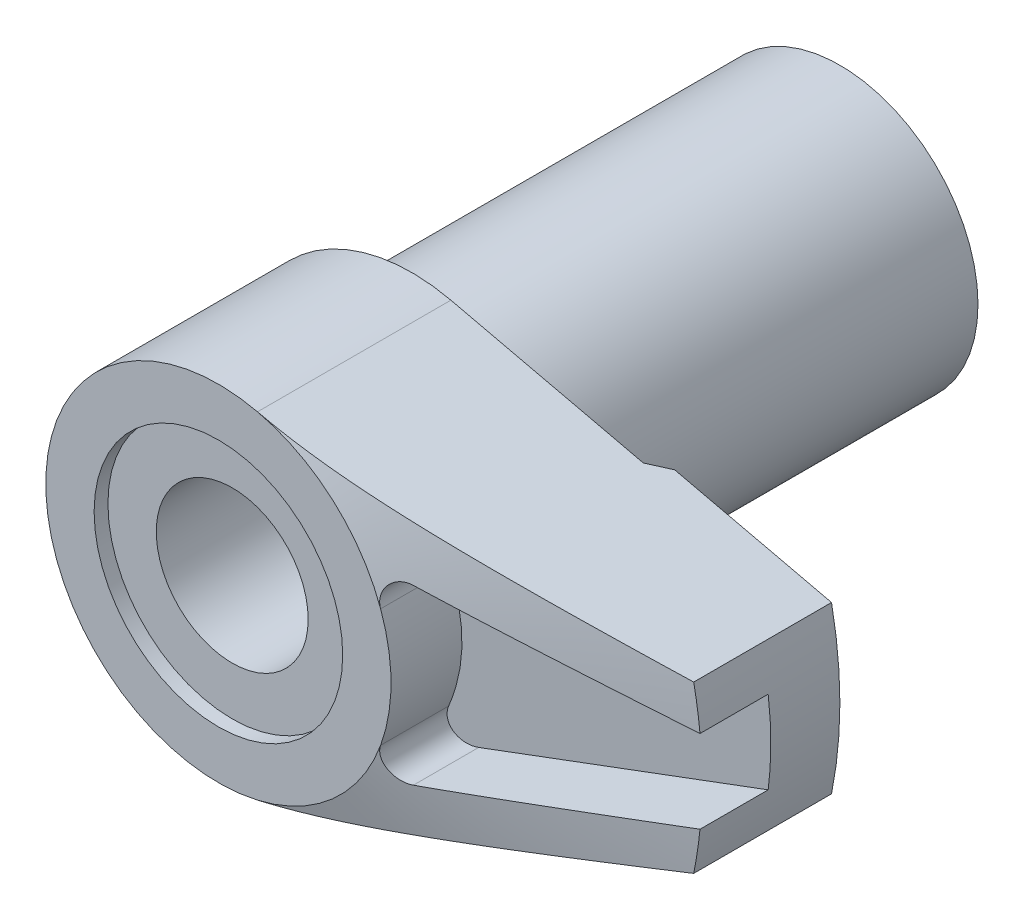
ISO-10303-21;
HEADER;
FILE_DESCRIPTION(('STEP AP214'),'2;1');
FILE_NAME('part.step','',(''),(''),'','','');
FILE_SCHEMA(('AUTOMOTIVE_DESIGN { 1 0 10303 214 1 1 1 1 }'));
ENDSEC;
DATA;
#1=APPLICATION_CONTEXT('core data for automotive mechanical design processes');
#2=APPLICATION_PROTOCOL_DEFINITION('international standard','automotive_design',2000,#1);
#3=PRODUCT_CONTEXT('',#1,'mechanical');
#4=PRODUCT('Part','Part','',(#3));
#5=PRODUCT_RELATED_PRODUCT_CATEGORY('part','',(#4));
#6=PRODUCT_DEFINITION_FORMATION('','',#4);
#7=PRODUCT_DEFINITION_CONTEXT('part definition',#1,'design');
#8=PRODUCT_DEFINITION('design','',#6,#7);
#9=PRODUCT_DEFINITION_SHAPE('','',#8);
#10=(LENGTH_UNIT() NAMED_UNIT(*) SI_UNIT(.MILLI.,.METRE.));
#11=(NAMED_UNIT(*) PLANE_ANGLE_UNIT() SI_UNIT($,.RADIAN.));
#12=(NAMED_UNIT(*) SI_UNIT($,.STERADIAN.) SOLID_ANGLE_UNIT());
#13=UNCERTAINTY_MEASURE_WITH_UNIT(LENGTH_MEASURE(1.E-05),#10,'distance_accuracy_value','');
#14=(GEOMETRIC_REPRESENTATION_CONTEXT(3) GLOBAL_UNCERTAINTY_ASSIGNED_CONTEXT((#13)) GLOBAL_UNIT_ASSIGNED_CONTEXT((#10,
#11,#12)) REPRESENTATION_CONTEXT('',''));
#15=CARTESIAN_POINT('',(0.,0.,0.));
#16=DIRECTION('',(0.,0.,1.));
#17=DIRECTION('',(1.,0.,0.));
#18=AXIS2_PLACEMENT_3D('',#15,#16,#17);
#19=CARTESIAN_POINT('',(29.8496231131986,-3.,45.));
#20=DIRECTION('',(0.195151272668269,-0.980773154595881,0.));
#21=DIRECTION('',(0.980773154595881,0.195151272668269,0.));
#22=AXIS2_PLACEMENT_3D('',#19,#20,#21);
#23=PLANE('',#22);
#24=CARTESIAN_POINT('',(29.8498231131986,-2.99996020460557,39.9783689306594));
#25=CARTESIAN_POINT('',(29.1687337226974,-3.13548130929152,40.1689219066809));
#26=CARTESIAN_POINT('',(28.487503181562,-3.2710304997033,40.3589529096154));
#27=CARTESIAN_POINT('',(27.1246794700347,-3.54220103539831,40.7376555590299));
#28=CARTESIAN_POINT('',(26.4430862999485,-3.67782238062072,40.9263272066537));
#29=CARTESIAN_POINT('',(25.0795104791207,-3.94914256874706,41.3019810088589));
#30=CARTESIAN_POINT('',(24.3975278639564,-4.08484140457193,41.488963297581));
#31=CARTESIAN_POINT('',(23.0330055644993,-4.35634992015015,41.8608024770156));
#32=CARTESIAN_POINT('',(22.350465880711,-4.49215959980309,42.0456593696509));
#33=CARTESIAN_POINT('',(20.9846213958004,-4.76393119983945,42.4126500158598));
#34=CARTESIAN_POINT('',(20.3013165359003,-4.89989313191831,42.5947835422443));
#35=CARTESIAN_POINT('',(18.9337996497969,-5.17199750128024,42.9554552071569));
#36=CARTESIAN_POINT('',(18.2495876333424,-5.30813993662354,43.1339933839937));
#37=CARTESIAN_POINT('',(17.2223410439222,-5.51253835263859,43.3981748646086));
#38=CARTESIAN_POINT('',(16.8797558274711,-5.58070492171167,43.4856347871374));
#39=CARTESIAN_POINT('',(16.1942391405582,-5.71710695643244,43.6591294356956));
#40=CARTESIAN_POINT('',(15.8513076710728,-5.78534242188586,43.7451641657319));
#41=CARTESIAN_POINT('',(15.1650328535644,-5.92189530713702,43.9155661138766));
#42=CARTESIAN_POINT('',(14.8216894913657,-5.99021272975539,43.9999332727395));
#43=CARTESIAN_POINT('',(14.1345343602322,-6.12694077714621,44.1666746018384));
#44=CARTESIAN_POINT('',(13.7907225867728,-6.19535140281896,44.2490487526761));
#45=CARTESIAN_POINT('',(13.4466456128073,-6.26381479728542,44.3302644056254));
#46=B_SPLINE_CURVE_WITH_KNOTS('',3,(#24,#25,#26,#27,#28,#29,#30,#31,#32,#33,#34,#35,#36,#37,#38,
#39,#40,#41,#42,#43,#44,#45),.UNSPECIFIED.,.F.,.F.,(4,2,2,2,2,2,2,2,2,2,4),(0.,2.16033236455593,
4.32066291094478,6.48082038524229,8.64097590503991,10.8013106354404,12.9616223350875,
14.0418721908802,15.1221190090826,16.2024041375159,17.2826997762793),.UNSPECIFIED.);
#47=CARTESIAN_POINT('',(29.8496231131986,-3.,39.9784248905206));
#48=VERTEX_POINT('',#47);
#49=CARTESIAN_POINT('',(13.4468456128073,-6.26377500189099,44.3302172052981));
#50=VERTEX_POINT('',#49);
#51=EDGE_CURVE('E35',#48,#50,#46,.T.);
#52=ORIENTED_EDGE('',*,*,#51,.F.);
#53=DIRECTION('',(0.,0.,-1.));
#54=VECTOR('',#53,1.);
#55=CARTESIAN_POINT('',(29.8496231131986,-3.,45.));
#56=LINE('',#55,#54);
#57=CARTESIAN_POINT('',(29.8496231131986,-3.,35.0417713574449));
#58=VERTEX_POINT('',#57);
#59=EDGE_CURVE('E268',#48,#58,#56,.T.);
#60=ORIENTED_EDGE('',*,*,#59,.T.);
#61=DIRECTION('',(0.946284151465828,0.188288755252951,-0.262856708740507));
#62=VECTOR('',#61,1.);
#63=CARTESIAN_POINT('',(27.3726418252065,-3.49286223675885,35.7298217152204));
#64=LINE('',#63,#62);
#65=CARTESIAN_POINT('',(13.4468456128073,-6.263775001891,39.5980984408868));
#66=VERTEX_POINT('',#65);
#67=EDGE_CURVE('E251',#66,#58,#64,.T.);
#68=ORIENTED_EDGE('',*,*,#67,.F.);
#69=DIRECTION('',(0.,0.,1.));
#70=VECTOR('',#69,1.);
#71=CARTESIAN_POINT('',(13.4468456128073,-6.26377500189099,35.));
#72=LINE('',#71,#70);
#73=EDGE_CURVE('E242',#66,#50,#72,.T.);
#74=ORIENTED_EDGE('',*,*,#73,.T.);
#75=EDGE_LOOP('',(#52,#60,#68,#74));
#76=FACE_BOUND('',#75,.T.);
#77=ADVANCED_FACE('F14',(#76),#23,.F.);
#78=CARTESIAN_POINT('',(29.3938769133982,6.,2.72821971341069));
#79=DIRECTION('',(0.226436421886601,0.974025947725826,0.));
#80=DIRECTION('',(-0.974025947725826,0.226436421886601,0.));
#81=AXIS2_PLACEMENT_3D('',#78,#79,#80);
#82=PLANE('',#81);
#83=DIRECTION('',(0.,0.,-1.));
#84=VECTOR('',#83,1.);
#85=CARTESIAN_POINT('',(2.83045527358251,12.1753243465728,80.3553390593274));
#86=LINE('',#85,#84);
#87=CARTESIAN_POINT('',(2.83045527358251,12.1753243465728,31.));
#88=VERTEX_POINT('',#87);
#89=CARTESIAN_POINT('',(2.83045527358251,12.1753243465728,45.));
#90=VERTEX_POINT('',#89);
#91=EDGE_CURVE('E139',#88,#90,#86,.F.);
#92=ORIENTED_EDGE('',*,*,#91,.T.);
#93=CARTESIAN_POINT('',(2.83025527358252,12.1753708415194,44.9999999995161));
#94=CARTESIAN_POINT('',(3.09211591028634,12.1144948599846,45.0000130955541));
#95=CARTESIAN_POINT('',(3.35397482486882,12.0536192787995,44.997514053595));
#96=CARTESIAN_POINT('',(3.87759687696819,11.931890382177,44.9875784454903));
#97=CARTESIAN_POINT('',(4.13936001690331,11.8710370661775,44.9801420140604));
#98=CARTESIAN_POINT('',(4.66262694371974,11.7493907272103,44.9604215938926));
#99=CARTESIAN_POINT('',(4.92413078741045,11.6885976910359,44.9481391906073));
#100=CARTESIAN_POINT('',(5.44688844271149,11.5670697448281,44.9188930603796));
#101=CARTESIAN_POINT('',(5.70814225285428,11.5063348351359,44.9019293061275));
#102=CARTESIAN_POINT('',(6.49037533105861,11.3244854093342,44.8443975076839));
#103=CARTESIAN_POINT('',(7.01089819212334,11.2034769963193,44.7971469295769));
#104=CARTESIAN_POINT('',(8.05036742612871,10.9618266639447,44.6868706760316));
#105=CARTESIAN_POINT('',(8.56931366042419,10.8411847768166,44.6238436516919));
#106=CARTESIAN_POINT('',(9.60376375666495,10.6007012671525,44.4845514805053));
#107=CARTESIAN_POINT('',(10.1192733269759,10.4808583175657,44.4083306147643));
#108=CARTESIAN_POINT('',(11.1485811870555,10.2415702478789,44.2447054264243));
#109=CARTESIAN_POINT('',(11.6623795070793,10.1221251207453,44.1573013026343));
#110=CARTESIAN_POINT('',(12.6886898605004,9.88353389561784,43.9732118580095));
#111=CARTESIAN_POINT('',(13.201200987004,9.76438800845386,43.8765212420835));
#112=CARTESIAN_POINT('',(14.2248137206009,9.52642391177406,43.6755593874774));
#113=CARTESIAN_POINT('',(14.7359153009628,9.40760570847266,43.5712880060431));
#114=CARTESIAN_POINT('',(15.8393219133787,9.15109155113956,43.3391980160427));
#115=CARTESIAN_POINT('',(16.4314101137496,9.01344600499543,43.2102962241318));
#116=CARTESIAN_POINT('',(17.6141698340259,8.73848425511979,42.9458355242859));
#117=CARTESIAN_POINT('',(18.2048413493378,8.60116805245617,42.8102765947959));
#118=CARTESIAN_POINT('',(19.3848692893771,8.32684137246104,42.5338554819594));
#119=CARTESIAN_POINT('',(19.9742259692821,8.18983083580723,42.3929944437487));
#120=CARTESIAN_POINT('',(21.1519474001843,7.91604036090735,42.1069682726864));
#121=CARTESIAN_POINT('',(21.7403121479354,7.77926042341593,41.9618031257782));
#122=CARTESIAN_POINT('',(22.9184201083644,7.5053800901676,41.6674151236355));
#123=CARTESIAN_POINT('',(23.5081601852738,7.36828042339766,41.5181790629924));
#124=CARTESIAN_POINT('',(24.6869369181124,7.09424461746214,41.216804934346));
#125=CARTESIAN_POINT('',(25.2759735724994,6.95730847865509,41.0646668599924));
#126=CARTESIAN_POINT('',(26.4534793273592,6.68356814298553,40.7579835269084));
#127=CARTESIAN_POINT('',(27.0419484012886,6.54676395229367,40.6034381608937));
#128=CARTESIAN_POINT('',(28.218374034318,6.27327471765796,40.2923263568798));
#129=CARTESIAN_POINT('',(28.8063305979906,6.13658967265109,40.1357599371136));
#130=CARTESIAN_POINT('',(29.3940769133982,5.99995350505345,39.9783713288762));
#131=B_SPLINE_CURVE_WITH_KNOTS('',3,(#93,#94,#95,#96,#97,#98,#99,#100,#101,#102,#103,#104,#105,
#106,#107,#108,#109,#110,#111,#112,#113,#114,#115,#116,#117,#118,#119,#120,#121,#122,#123,#124,
#125,#126,#127,#128,#129,#130),.UNSPECIFIED.,.F.,.F.,(4,2,2,2,2,2,2,2,2,2,2,2,2,2,2,2,2,2,4),
(0.,0.806516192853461,1.61301038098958,2.41924092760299,3.22547617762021,4.83464442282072,
6.44395030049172,8.04795620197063,9.65193359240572,11.2568310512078,12.861758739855,
14.7258920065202,16.5900313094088,18.4537702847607,20.3175153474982,22.1882685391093,
24.0590258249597,25.9298667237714,27.8006907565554),.UNSPECIFIED.);
#132=CARTESIAN_POINT('',(29.3938769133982,6.,39.9784248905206));
#133=VERTEX_POINT('',#132);
#134=EDGE_CURVE('E110',#90,#133,#131,.T.);
#135=ORIENTED_EDGE('',*,*,#134,.T.);
#136=DIRECTION('',(0.,0.,-1.));
#137=VECTOR('',#136,1.);
#138=CARTESIAN_POINT('',(29.3938769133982,6.,45.));
#139=LINE('',#138,#137);
#140=CARTESIAN_POINT('',(29.3938769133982,6.,30.));
#141=VERTEX_POINT('',#140);
#142=EDGE_CURVE('E295',#133,#141,#139,.T.);
#143=ORIENTED_EDGE('',*,*,#142,.T.);
#144=DIRECTION('',(0.974025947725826,-0.226436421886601,0.));
#145=VECTOR('',#144,1.);
#146=CARTESIAN_POINT('',(29.3938769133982,6.,30.));
#147=LINE('',#146,#145);
#148=CARTESIAN_POINT('',(18.0374305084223,8.64008684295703,30.));
#149=VERTEX_POINT('',#148);
#150=EDGE_CURVE('E142',#149,#141,#147,.T.);
#151=ORIENTED_EDGE('',*,*,#150,.F.);
#152=CARTESIAN_POINT('',(30.4238571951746,5.76055560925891,19.0355835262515));
#153=CARTESIAN_POINT('',(30.028822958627,5.85239108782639,19.4066268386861));
#154=CARTESIAN_POINT('',(29.6331674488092,5.94437099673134,19.7769743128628));
#155=CARTESIAN_POINT('',(28.8404369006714,6.12866081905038,20.5160704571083));
#156=CARTESIAN_POINT('',(28.443361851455,6.22097073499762,20.8848191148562));
#157=CARTESIAN_POINT('',(27.647548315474,6.40597727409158,21.6205722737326));
#158=CARTESIAN_POINT('',(27.2488095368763,6.4986739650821,21.9875764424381));
#159=CARTESIAN_POINT('',(26.4495266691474,6.68448703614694,22.7195031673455));
#160=CARTESIAN_POINT('',(26.0489825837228,6.77760341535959,23.0844257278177));
#161=CARTESIAN_POINT('',(24.8423212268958,7.05812169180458,24.1774168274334));
#162=CARTESIAN_POINT('',(24.0331157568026,7.24624151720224,24.9019094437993));
#163=CARTESIAN_POINT('',(22.8112301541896,7.53029904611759,25.9789264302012));
#164=CARTESIAN_POINT('',(22.4026033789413,7.62529444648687,26.3362992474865));
#165=CARTESIAN_POINT('',(21.5822014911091,7.81601715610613,27.047210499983));
#166=CARTESIAN_POINT('',(21.1704263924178,7.91174446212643,27.4007489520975));
#167=CARTESIAN_POINT('',(20.1078304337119,8.15877117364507,28.3032347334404));
#168=CARTESIAN_POINT('',(19.454335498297,8.31069223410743,28.8488840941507));
#169=CARTESIAN_POINT('',(18.4653749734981,8.54060056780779,29.6562027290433));
#170=CARTESIAN_POINT('',(18.1342417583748,8.61758067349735,29.9234705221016));
#171=CARTESIAN_POINT('',(17.4686623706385,8.77231106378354,30.4536179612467));
#172=CARTESIAN_POINT('',(17.1342162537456,8.85006133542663,30.7164976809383));
#173=CARTESIAN_POINT('',(16.4612692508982,9.00650451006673,31.2372989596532));
#174=CARTESIAN_POINT('',(16.122765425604,9.08519809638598,31.4952165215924));
#175=CARTESIAN_POINT('',(15.4413841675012,9.24360202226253,32.0049142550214));
#176=CARTESIAN_POINT('',(15.09850665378,9.32331238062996,32.2566943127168));
#177=CARTESIAN_POINT('',(14.407798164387,9.48388465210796,32.7528400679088));
#178=CARTESIAN_POINT('',(14.0599683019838,9.56474630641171,32.9972073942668));
#179=CARTESIAN_POINT('',(13.3585364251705,9.72781149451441,33.4770235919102));
#180=CARTESIAN_POINT('',(13.0049347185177,9.81001495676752,33.7124729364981));
#181=CARTESIAN_POINT('',(12.1958873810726,9.99809802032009,34.2338707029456));
#182=CARTESIAN_POINT('',(11.738424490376,10.1044465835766,34.5165458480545));
#183=CARTESIAN_POINT('',(10.8107412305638,10.3201095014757,35.0593294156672));
#184=CARTESIAN_POINT('',(10.3405184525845,10.4294244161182,35.3194335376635));
#185=CARTESIAN_POINT('',(9.38628058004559,10.6512606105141,35.8094410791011));
#186=CARTESIAN_POINT('',(8.90229191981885,10.7637757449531,36.0393981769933));
#187=CARTESIAN_POINT('',(7.91839714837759,10.9925064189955,36.4602128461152));
#188=CARTESIAN_POINT('',(7.41849963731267,11.1087199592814,36.6510911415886));
#189=CARTESIAN_POINT('',(6.55736713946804,11.3089115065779,36.9320127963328));
#190=CARTESIAN_POINT('',(6.20017299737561,11.3919501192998,37.0350701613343));
#191=CARTESIAN_POINT('',(5.4790708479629,11.5595881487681,37.2126902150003));
#192=CARTESIAN_POINT('',(5.11516374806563,11.6441873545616,37.2872567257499));
#193=CARTESIAN_POINT('',(4.38384772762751,11.8141998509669,37.4041054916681));
#194=CARTESIAN_POINT('',(4.01645796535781,11.8996086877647,37.4465123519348));
#195=CARTESIAN_POINT('',(3.27943136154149,12.0709487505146,37.497198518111));
#196=CARTESIAN_POINT('',(2.90979463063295,12.1568799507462,37.5054794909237));
#197=CARTESIAN_POINT('',(2.17169328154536,12.3284698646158,37.4874440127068));
#198=CARTESIAN_POINT('',(1.80322787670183,12.4141287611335,37.4611609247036));
#199=CARTESIAN_POINT('',(1.06998217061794,12.5845898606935,37.3755469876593));
#200=CARTESIAN_POINT('',(0.705202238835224,12.6693919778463,37.3162128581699));
#201=CARTESIAN_POINT('',(-0.0217078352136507,12.8383802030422,37.1668595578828));
#202=CARTESIAN_POINT('',(-0.383784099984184,12.9225537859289,37.0765674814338));
#203=CARTESIAN_POINT('',(-1.10051607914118,13.089175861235,36.869388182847));
#204=CARTESIAN_POINT('',(-1.45517196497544,13.1716243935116,36.7525015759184));
#205=CARTESIAN_POINT('',(-2.37697845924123,13.3859211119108,36.4157336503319));
#206=CARTESIAN_POINT('',(-2.93770477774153,13.5162758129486,36.1772699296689));
#207=CARTESIAN_POINT('',(-3.76392729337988,13.7083516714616,35.7865176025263));
#208=CARTESIAN_POINT('',(-4.03708001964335,13.7718527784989,35.6506293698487));
#209=CARTESIAN_POINT('',(-4.57872104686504,13.8977706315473,35.3693760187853));
#210=CARTESIAN_POINT('',(-4.84720970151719,13.9601874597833,35.2240116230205));
#211=CARTESIAN_POINT('',(-5.37300606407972,14.0824218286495,34.9290335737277));
#212=CARTESIAN_POINT('',(-5.63042376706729,14.142264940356,34.7796252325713));
#213=CARTESIAN_POINT('',(-6.14151246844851,14.2610801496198,34.4741799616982));
#214=CARTESIAN_POINT('',(-6.3951832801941,14.3200522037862,34.3181427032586));
#215=CARTESIAN_POINT('',(-6.89816333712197,14.4369823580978,34.0009466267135));
#216=CARTESIAN_POINT('',(-7.14748526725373,14.4949434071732,33.8398089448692));
#217=CARTESIAN_POINT('',(-7.6429887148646,14.610135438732,33.5126224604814));
#218=CARTESIAN_POINT('',(-7.88917082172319,14.6673665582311,33.346574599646));
#219=CARTESIAN_POINT('',(-8.13396120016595,14.7242741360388,33.1784194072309));
#220=B_SPLINE_CURVE_WITH_KNOTS('',3,(#152,#153,#154,#155,#156,#157,#158,#159,#160,#161,#162,
#163,#164,#165,#166,#167,#168,#169,#170,#171,#172,#173,#174,#175,#176,#177,#178,#179,#180,#181,
#182,#183,#184,#185,#186,#187,#188,#189,#190,#191,#192,#193,#194,#195,#196,#197,#198,#199,#200,
#201,#202,#203,#204,#205,#206,#207,#208,#209,#210,#211,#212,#213,#214,#215,#216,#217,#218,#219),
.UNSPECIFIED.,.F.,.F.,(4,2,2,2,2,2,2,2,2,2,2,2,2,2,2,2,2,2,2,2,2,2,2,2,2,2,2,2,2,2,2,2,2,4),(0.,
1.64907000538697,3.29815269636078,4.94753795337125,6.59691982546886,9.90373771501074,
11.5570292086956,13.21031341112,15.8045053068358,17.101807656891,18.3990882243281,
19.6973733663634,20.9956825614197,22.2937043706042,23.5916571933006,25.2356725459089,
26.8800004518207,28.5213595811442,30.1618459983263,31.3036669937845,32.4453347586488,
33.5825561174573,34.7197219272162,35.8557908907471,36.9919726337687,38.1384393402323,
39.2848795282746,41.1512859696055,42.0860599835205,43.0207627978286,43.931436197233,
44.8421548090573,45.7494964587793,46.6566652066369),.UNSPECIFIED.);
#221=CARTESIAN_POINT('',(16.7678782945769,8.9352256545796,31.));
#222=VERTEX_POINT('',#221);
#223=EDGE_CURVE('E182',#149,#222,#220,.T.);
#224=ORIENTED_EDGE('',*,*,#223,.T.);
#225=DIRECTION('',(-0.974025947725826,0.226436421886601,0.));
#226=VECTOR('',#225,1.);
#227=CARTESIAN_POINT('',(29.3938769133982,6.,31.));
#228=LINE('',#227,#226);
#229=EDGE_CURVE('E147',#222,#88,#228,.T.);
#230=ORIENTED_EDGE('',*,*,#229,.T.);
#231=EDGE_LOOP('',(#92,#135,#143,#151,#224,#230));
#232=FACE_BOUND('',#231,.T.);
#233=ADVANCED_FACE('F144',(#232),#82,.T.);
#234=CARTESIAN_POINT('',(29.3938769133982,-6.,2.72821971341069));
#235=DIRECTION('',(0.226436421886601,-0.974025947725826,0.));
#236=DIRECTION('',(0.974025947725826,0.226436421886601,0.));
#237=AXIS2_PLACEMENT_3D('',#234,#235,#236);
#238=PLANE('',#237);
#239=DIRECTION('',(0.,0.,-1.));
#240=VECTOR('',#239,1.);
#241=CARTESIAN_POINT('',(29.3938769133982,-6.,45.));
#242=LINE('',#241,#240);
#243=CARTESIAN_POINT('',(29.3938769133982,-6.,39.9784248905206));
#244=VERTEX_POINT('',#243);
#245=CARTESIAN_POINT('',(29.3938769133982,-6.,30.));
#246=VERTEX_POINT('',#245);
#247=EDGE_CURVE('E293',#244,#246,#242,.T.);
#248=ORIENTED_EDGE('',*,*,#247,.F.);
#249=CARTESIAN_POINT('',(29.3940769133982,-5.99995350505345,39.9783713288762));
#250=CARTESIAN_POINT('',(28.8485896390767,-6.12676551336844,40.1244466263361));
#251=CARTESIAN_POINT('',(28.3029205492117,-6.25361978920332,40.2698101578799));
#252=CARTESIAN_POINT('',(27.2111472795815,-6.50742948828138,40.5588186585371));
#253=CARTESIAN_POINT('',(26.6650430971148,-6.63438491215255,40.7024636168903));
#254=CARTESIAN_POINT('',(25.5724235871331,-6.88839134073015,40.9877149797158));
#255=CARTESIAN_POINT('',(25.0259083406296,-7.01544232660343,41.1293217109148));
#256=CARTESIAN_POINT('',(23.9322935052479,-7.26968014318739,41.410136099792));
#257=CARTESIAN_POINT('',(23.3851939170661,-7.39686697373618,41.5493437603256));
#258=CARTESIAN_POINT('',(22.2920577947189,-7.65099350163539,41.8244459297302));
#259=CARTESIAN_POINT('',(21.7460234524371,-7.77793268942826,41.9603496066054));
#260=CARTESIAN_POINT('',(20.6531526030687,-8.03199754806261,42.22871213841));
#261=CARTESIAN_POINT('',(20.106316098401,-8.15912321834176,42.3611710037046));
#262=CARTESIAN_POINT('',(19.0115471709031,-8.41362933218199,42.6219358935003));
#263=CARTESIAN_POINT('',(18.4636144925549,-8.54100983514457,42.7502407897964));
#264=CARTESIAN_POINT('',(17.3666282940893,-8.79603140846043,43.0017183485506));
#265=CARTESIAN_POINT('',(16.8175747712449,-8.92367247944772,43.1248909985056));
#266=CARTESIAN_POINT('',(15.7157637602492,-9.1798156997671,43.3654313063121));
#267=CARTESIAN_POINT('',(15.1630005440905,-9.30831918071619,43.4827714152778));
#268=CARTESIAN_POINT('',(14.0559308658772,-9.56568490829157,43.7095424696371));
#269=CARTESIAN_POINT('',(13.5016244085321,-9.69454715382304,43.8189734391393));
#270=CARTESIAN_POINT('',(12.3916067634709,-9.95259820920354,44.0279529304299));
#271=CARTESIAN_POINT('',(11.8358967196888,-10.0817867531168,44.1275078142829));
#272=CARTESIAN_POINT('',(10.7225132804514,-10.3406202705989,44.3145027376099));
#273=CARTESIAN_POINT('',(10.1648398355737,-10.4702652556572,44.4019424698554));
#274=CARTESIAN_POINT('',(9.04556324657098,-10.7304687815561,44.5622855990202));
#275=CARTESIAN_POINT('',(8.48395318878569,-10.8610289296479,44.635138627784));
#276=CARTESIAN_POINT('',(7.35882855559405,-11.1225919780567,44.7629959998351));
#277=CARTESIAN_POINT('',(6.79531420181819,-11.2535948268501,44.8180023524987));
#278=CARTESIAN_POINT('',(5.94825295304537,-11.4505151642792,44.8851357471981));
#279=CARTESIAN_POINT('',(5.66527413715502,-11.5163005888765,44.9049647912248));
#280=CARTESIAN_POINT('',(5.09900304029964,-11.6479443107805,44.9391832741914));
#281=CARTESIAN_POINT('',(4.81571076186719,-11.7138026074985,44.9535727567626));
#282=CARTESIAN_POINT('',(4.24878662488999,-11.8455981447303,44.976690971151));
#283=CARTESIAN_POINT('',(3.96515467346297,-11.911535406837,44.9854173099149));
#284=CARTESIAN_POINT('',(3.39776773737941,-12.0434385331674,44.9970807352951));
#285=CARTESIAN_POINT('',(3.11401274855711,-12.1094043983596,45.0000176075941));
#286=CARTESIAN_POINT('',(2.83025527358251,-12.1753708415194,44.9999999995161));
#287=B_SPLINE_CURVE_WITH_KNOTS('',3,(#249,#250,#251,#252,#253,#254,#255,#256,#257,#258,#259,
#260,#261,#262,#263,#264,#265,#266,#267,#268,#269,#270,#271,#272,#273,#274,#275,#276,#277,#278,
#279,#280,#281,#282,#283,#284,#285,#286),.UNSPECIFIED.,.F.,.F.,(4,2,2,2,2,2,2,2,2,2,2,2,2,2,2,2,
2,2,4),(0.,1.73631340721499,3.47263768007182,5.2086804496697,6.94472115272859,8.67521268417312,
10.4056990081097,12.1366514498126,13.8676081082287,15.6060859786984,17.3445585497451,
19.0819038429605,20.8192931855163,22.5625820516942,24.3056745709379,25.179234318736,
26.0527870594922,26.9267086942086,27.8006626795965),.UNSPECIFIED.);
#288=CARTESIAN_POINT('',(2.83045527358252,-12.1753243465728,45.));
#289=VERTEX_POINT('',#288);
#290=EDGE_CURVE('E230',#244,#289,#287,.T.);
#291=ORIENTED_EDGE('',*,*,#290,.T.);
#292=DIRECTION('',(0.,0.,-1.));
#293=VECTOR('',#292,1.);
#294=CARTESIAN_POINT('',(2.83045527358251,-12.1753243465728,80.3553390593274));
#295=LINE('',#294,#293);
#296=CARTESIAN_POINT('',(2.83045527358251,-12.1753243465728,31.));
#297=VERTEX_POINT('',#296);
#298=EDGE_CURVE('E141',#297,#289,#295,.F.);
#299=ORIENTED_EDGE('',*,*,#298,.F.);
#300=DIRECTION('',(0.974025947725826,0.226436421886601,0.));
#301=VECTOR('',#300,1.);
#302=CARTESIAN_POINT('',(29.3938769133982,-6.,31.));
#303=LINE('',#302,#301);
#304=CARTESIAN_POINT('',(16.7678782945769,-8.9352256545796,31.));
#305=VERTEX_POINT('',#304);
#306=EDGE_CURVE('E28',#297,#305,#303,.T.);
#307=ORIENTED_EDGE('',*,*,#306,.T.);
#308=CARTESIAN_POINT('',(-8.13396120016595,-14.7242741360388,33.1784194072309));
#309=CARTESIAN_POINT('',(-7.86694439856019,-14.6621994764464,33.3618344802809));
#310=CARTESIAN_POINT('',(-7.5982735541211,-14.5997402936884,33.5427522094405));
#311=CARTESIAN_POINT('',(-7.05714860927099,-14.4739424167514,33.8986786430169));
#312=CARTESIAN_POINT('',(-6.78469353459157,-14.4106034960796,34.0736857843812));
#313=CARTESIAN_POINT('',(-6.23414040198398,-14.2826138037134,34.4177319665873));
#314=CARTESIAN_POINT('',(-5.9560194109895,-14.2179577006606,34.5867324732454));
#315=CARTESIAN_POINT('',(-5.3951951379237,-14.0875802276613,34.9164882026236));
#316=CARTESIAN_POINT('',(-5.11249216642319,-14.0218589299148,35.0772439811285));
#317=CARTESIAN_POINT('',(-4.53313396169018,-13.8871727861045,35.3939210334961));
#318=CARTESIAN_POINT('',(-4.23631841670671,-13.8181706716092,35.5495357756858));
#319=CARTESIAN_POINT('',(-3.63690295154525,-13.6788217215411,35.8485026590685));
#320=CARTESIAN_POINT('',(-3.33430256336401,-13.6084747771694,35.9918538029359));
#321=CARTESIAN_POINT('',(-2.41844454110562,-13.3955609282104,36.3995832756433));
#322=CARTESIAN_POINT('',(-1.79563314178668,-13.2507730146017,36.6424803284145));
#323=CARTESIAN_POINT('',(-0.797395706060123,-13.0187080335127,36.9617057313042));
#324=CARTESIAN_POINT('',(-0.430060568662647,-12.9333118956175,37.0648475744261));
#325=CARTESIAN_POINT('',(0.311610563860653,-12.7608920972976,37.2406754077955));
#326=CARTESIAN_POINT('',(0.685946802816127,-12.6738683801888,37.3133603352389));
#327=CARTESIAN_POINT('',(1.43519243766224,-12.4996877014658,37.423877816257));
#328=CARTESIAN_POINT('',(1.81004701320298,-12.4125434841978,37.4620969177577));
#329=CARTESIAN_POINT('',(2.56160114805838,-12.2378261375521,37.5028870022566));
#330=CARTESIAN_POINT('',(2.93830057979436,-12.1502530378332,37.5054604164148));
#331=CARTESIAN_POINT('',(3.69155699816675,-11.9751399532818,37.4747554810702));
#332=CARTESIAN_POINT('',(4.06810923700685,-11.887601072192,37.4413564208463));
#333=CARTESIAN_POINT('',(4.81682395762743,-11.7135438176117,37.3404739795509));
#334=CARTESIAN_POINT('',(5.18898596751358,-11.6270255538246,37.2729869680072));
#335=CARTESIAN_POINT('',(5.92890202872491,-11.455013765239,37.1069434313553));
#336=CARTESIAN_POINT('',(6.29661670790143,-11.3695293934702,37.0082045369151));
#337=CARTESIAN_POINT('',(7.02415393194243,-11.2003953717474,36.7840783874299));
#338=CARTESIAN_POINT('',(7.38397646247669,-11.116745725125,36.6586910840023));
#339=CARTESIAN_POINT('',(8.17165664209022,-10.9336299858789,36.356285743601));
#340=CARTESIAN_POINT('',(8.59756881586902,-10.8346161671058,36.1739616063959));
#341=CARTESIAN_POINT('',(9.43792365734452,-10.6392548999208,35.7831047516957));
#342=CARTESIAN_POINT('',(9.85236050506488,-10.5429088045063,35.5745590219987));
#343=CARTESIAN_POINT('',(10.6714726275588,-10.3524859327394,35.1364456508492));
#344=CARTESIAN_POINT('',(11.0761278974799,-10.2584138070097,34.9068388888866));
#345=CARTESIAN_POINT('',(11.8760990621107,-10.0724407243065,34.4313221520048));
#346=CARTESIAN_POINT('',(12.2714164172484,-9.98053942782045,34.1854147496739));
#347=CARTESIAN_POINT('',(13.0579820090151,-9.79768280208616,33.6780563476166));
#348=CARTESIAN_POINT('',(13.4491495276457,-9.70674623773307,33.4164740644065));
#349=CARTESIAN_POINT('',(14.2245110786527,-9.52649426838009,32.8826501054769));
#350=CARTESIAN_POINT('',(14.6087049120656,-9.43717890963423,32.610408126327));
#351=CARTESIAN_POINT('',(15.3706991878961,-9.26003449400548,32.0575885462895));
#352=CARTESIAN_POINT('',(15.7485062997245,-9.17220388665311,31.7770206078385));
#353=CARTESIAN_POINT('',(16.4990321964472,-8.99772557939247,31.2087918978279));
#354=CARTESIAN_POINT('',(16.8717508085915,-8.91107791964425,30.9211308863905));
#355=CARTESIAN_POINT('',(17.8280308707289,-8.6887669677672,30.1711734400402));
#356=CARTESIAN_POINT('',(18.4083222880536,-8.55386387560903,29.7044842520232));
#357=CARTESIAN_POINT('',(19.5602783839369,-8.2860631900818,28.7600155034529));
#358=CARTESIAN_POINT('',(20.1319427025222,-8.15316568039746,28.2822354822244));
#359=CARTESIAN_POINT('',(21.268641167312,-7.88891200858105,27.3178027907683));
#360=CARTESIAN_POINT('',(21.833671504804,-7.75755673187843,26.8311453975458));
#361=CARTESIAN_POINT('',(22.9580945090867,-7.49615679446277,25.8510135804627));
#362=CARTESIAN_POINT('',(23.5174871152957,-7.36611214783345,25.3575390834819));
#363=CARTESIAN_POINT('',(24.6108598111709,-7.11193062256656,24.3836170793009));
#364=CARTESIAN_POINT('',(25.1450095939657,-6.98775429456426,23.9033701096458));
#365=CARTESIAN_POINT('',(26.2097200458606,-6.74023601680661,22.9386956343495));
#366=CARTESIAN_POINT('',(26.7402806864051,-6.61689407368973,22.4542680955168));
#367=CARTESIAN_POINT('',(27.7978204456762,-6.37104280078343,21.4824553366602));
#368=CARTESIAN_POINT('',(28.3248027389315,-6.24853273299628,20.9950737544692));
#369=CARTESIAN_POINT('',(29.3761678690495,-6.00411690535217,20.0173900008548));
#370=CARTESIAN_POINT('',(29.9005507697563,-5.88221113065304,19.5270879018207));
#371=CARTESIAN_POINT('',(30.4238571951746,-5.76055560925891,19.0355835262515));
#372=B_SPLINE_CURVE_WITH_KNOTS('',3,(#308,#309,#310,#311,#312,#313,#314,#315,#316,#317,#318,
#319,#320,#321,#322,#323,#324,#325,#326,#327,#328,#329,#330,#331,#332,#333,#334,#335,#336,#337,
#338,#339,#340,#341,#342,#343,#344,#345,#346,#347,#348,#349,#350,#351,#352,#353,#354,#355,#356,
#357,#358,#359,#360,#361,#362,#363,#364,#365,#366,#367,#368,#369,#370,#371),.UNSPECIFIED.,.F.,
.F.,(4,2,2,2,2,2,2,2,2,2,2,2,2,2,2,2,2,2,2,2,2,2,2,2,2,2,2,2,2,2,2,4),(0.,0.989530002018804,
1.9793196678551,2.97460523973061,3.96982363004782,4.99603984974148,6.02233944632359,
8.06969533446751,9.24162375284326,10.4135930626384,11.5722486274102,12.7308251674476,
13.8933016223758,15.0559019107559,16.2254156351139,17.3949314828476,18.8150845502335,
20.2359451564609,21.6595006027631,23.0828319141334,24.5204553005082,25.9581196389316,
27.3941761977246,28.8302813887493,31.1004692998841,33.3707516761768,35.6422793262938,
37.9138313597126,40.1006661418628,42.2875183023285,44.4720752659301,46.6565783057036),.UNSPECIFIED.);
#373=CARTESIAN_POINT('',(18.0374305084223,-8.64008684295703,30.));
#374=VERTEX_POINT('',#373);
#375=EDGE_CURVE('E151',#305,#374,#372,.T.);
#376=ORIENTED_EDGE('',*,*,#375,.T.);
#377=DIRECTION('',(-0.974025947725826,-0.226436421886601,0.));
#378=VECTOR('',#377,1.);
#379=CARTESIAN_POINT('',(29.3938769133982,-6.,30.));
#380=LINE('',#379,#378);
#381=EDGE_CURVE('E308',#246,#374,#380,.T.);
#382=ORIENTED_EDGE('',*,*,#381,.F.);
#383=EDGE_LOOP('',(#248,#291,#299,#307,#376,#382));
#384=FACE_BOUND('',#383,.T.);
#385=ADVANCED_FACE('F165',(#384),#238,.T.);
#386=CARTESIAN_POINT('',(0.,0.,45.));
#387=DIRECTION('',(0.,0.,-1.));
#388=DIRECTION('',(-1.,0.,0.));
#389=AXIS2_PLACEMENT_3D('',#386,#387,#388);
#390=CYLINDRICAL_SURFACE('',#389,30.);
#391=CARTESIAN_POINT('',(0.,0.,39.9784248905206));
#392=DIRECTION('',(0.,0.,-1.));
#393=DIRECTION('',(-1.,0.,0.));
#394=AXIS2_PLACEMENT_3D('',#391,#392,#393);
#395=CIRCLE('',#394,30.);
#396=EDGE_CURVE('E229',#244,#48,#395,.F.);
#397=ORIENTED_EDGE('',*,*,#396,.F.);
#398=ORIENTED_EDGE('',*,*,#247,.T.);
#399=CARTESIAN_POINT('',(0.,0.,30.));
#400=DIRECTION('',(0.,0.,1.));
#401=DIRECTION('',(1.,0.,0.));
#402=AXIS2_PLACEMENT_3D('',#399,#400,#401);
#403=CIRCLE('',#402,30.);
#404=EDGE_CURVE('E287',#246,#141,#403,.T.);
#405=ORIENTED_EDGE('',*,*,#404,.T.);
#406=ORIENTED_EDGE('',*,*,#142,.F.);
#407=CARTESIAN_POINT('',(29.8496231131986,3.,39.9784248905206));
#408=VERTEX_POINT('',#407);
#409=EDGE_CURVE('E115',#408,#133,#395,.F.);
#410=ORIENTED_EDGE('',*,*,#409,.F.);
#411=DIRECTION('',(0.,0.,-1.));
#412=VECTOR('',#411,1.);
#413=CARTESIAN_POINT('',(29.8496231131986,3.,45.));
#414=LINE('',#413,#412);
#415=CARTESIAN_POINT('',(29.8496231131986,3.,35.0417713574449));
#416=VERTEX_POINT('',#415);
#417=EDGE_CURVE('E269',#408,#416,#414,.T.);
#418=ORIENTED_EDGE('',*,*,#417,.T.);
#419=CARTESIAN_POINT('',(0.,0.,43.3333333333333));
#420=DIRECTION('',(-0.267643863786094,0.,-0.963517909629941));
#421=DIRECTION('',(0.963517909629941,0.,-0.267643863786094));
#422=AXIS2_PLACEMENT_3D('',#419,#420,#421);
#423=ELLIPSE('',#422,31.135902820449,30.);
#424=EDGE_CURVE('E149',#58,#416,#423,.F.);
#425=ORIENTED_EDGE('',*,*,#424,.F.);
#426=ORIENTED_EDGE('',*,*,#59,.F.);
#427=EDGE_LOOP('',(#397,#398,#405,#406,#410,#418,#425,#426));
#428=FACE_BOUND('',#427,.T.);
#429=ADVANCED_FACE('F16',(#428),#390,.T.);
#430=CARTESIAN_POINT('',(29.8496231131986,3.,45.));
#431=DIRECTION('',(0.195151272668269,0.980773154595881,0.));
#432=DIRECTION('',(-0.980773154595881,0.195151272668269,0.));
#433=AXIS2_PLACEMENT_3D('',#430,#431,#432);
#434=PLANE('',#433);
#435=CARTESIAN_POINT('',(13.4466456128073,6.26381479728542,44.3302644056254));
#436=CARTESIAN_POINT('',(13.7479293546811,6.20386627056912,44.2591546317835));
#437=CARTESIAN_POINT('',(14.0490084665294,6.14395846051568,44.1871504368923));
#438=CARTESIAN_POINT('',(14.650801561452,6.02421549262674,44.0415817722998));
#439=CARTESIAN_POINT('',(14.9515155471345,5.96438033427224,43.9680173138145));
#440=CARTESIAN_POINT('',(15.8531650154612,5.78497285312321,43.7453291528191));
#441=CARTESIAN_POINT('',(16.4536255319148,5.66549503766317,43.5942065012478));
#442=CARTESIAN_POINT('',(17.653519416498,5.42674378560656,43.287965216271));
#443=CARTESIAN_POINT('',(18.2529528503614,5.30747033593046,43.1328468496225));
#444=CARTESIAN_POINT('',(19.4510494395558,5.06907670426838,42.8195306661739));
#445=CARTESIAN_POINT('',(20.0497125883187,4.94995652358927,42.6613328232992));
#446=CARTESIAN_POINT('',(21.246363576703,4.71185053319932,42.3425508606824));
#447=CARTESIAN_POINT('',(21.8443514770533,4.5928647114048,42.1819669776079));
#448=CARTESIAN_POINT('',(23.0398286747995,4.35499227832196,41.8588903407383));
#449=CARTESIAN_POINT('',(23.6373179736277,4.23610566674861,41.6963975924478));
#450=CARTESIAN_POINT('',(25.4292026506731,3.87956187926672,41.2066314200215));
#451=CARTESIAN_POINT('',(26.6229977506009,3.64202414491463,40.8770746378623));
#452=CARTESIAN_POINT('',(28.1552570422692,3.33713983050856,40.4512745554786));
#453=CARTESIAN_POINT('',(28.4942235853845,3.26969329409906,40.3569024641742));
#454=CARTESIAN_POINT('',(29.17208004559,3.13481546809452,40.1678556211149));
#455=CARTESIAN_POINT('',(29.510969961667,3.06738417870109,40.073180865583));
#456=CARTESIAN_POINT('',(29.8498231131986,2.99996020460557,39.9783689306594));
#457=B_SPLINE_CURVE_WITH_KNOTS('',3,(#435,#436,#437,#438,#439,#440,#441,#442,#443,#444,#445,
#446,#447,#448,#449,#450,#451,#452,#453,#454,#455,#456),.UNSPECIFIED.,.F.,.F.,(4,2,2,2,2,2,2,2,
2,2,4),(0.,0.945935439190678,1.89186408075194,3.78366633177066,5.67534261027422,
7.56703491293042,9.45854081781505,11.3500412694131,15.1330961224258,16.2078896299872,
17.2826966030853),.UNSPECIFIED.);
#458=CARTESIAN_POINT('',(13.4468456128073,6.26377500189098,44.3302172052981));
#459=VERTEX_POINT('',#458);
#460=EDGE_CURVE('E132',#459,#408,#457,.T.);
#461=ORIENTED_EDGE('',*,*,#460,.F.);
#462=DIRECTION('',(0.,0.,1.));
#463=VECTOR('',#462,1.);
#464=CARTESIAN_POINT('',(13.4468456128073,6.26377500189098,35.));
#465=LINE('',#464,#463);
#466=CARTESIAN_POINT('',(13.4468456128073,6.26377500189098,39.5980984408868));
#467=VERTEX_POINT('',#466);
#468=EDGE_CURVE('E43',#467,#459,#465,.T.);
#469=ORIENTED_EDGE('',*,*,#468,.F.);
#470=DIRECTION('',(-0.946284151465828,0.188288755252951,0.262856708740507));
#471=VECTOR('',#470,1.);
#472=CARTESIAN_POINT('',(27.3726418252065,3.49286223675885,35.7298217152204));
#473=LINE('',#472,#471);
#474=EDGE_CURVE('E266',#416,#467,#473,.T.);
#475=ORIENTED_EDGE('',*,*,#474,.F.);
#476=ORIENTED_EDGE('',*,*,#417,.F.);
#477=EDGE_LOOP('',(#461,#469,#475,#476));
#478=FACE_BOUND('',#477,.T.);
#479=ADVANCED_FACE('F315',(#478),#434,.F.);
#480=CARTESIAN_POINT('',(0.,0.,45.));
#481=DIRECTION('',(0.,0.,1.));
#482=DIRECTION('',(1.,0.,0.));
#483=AXIS2_PLACEMENT_3D('',#480,#481,#482);
#484=PLANE('',#483);
#485=CARTESIAN_POINT('',(0.,0.,45.));
#486=DIRECTION('',(0.,0.,1.));
#487=DIRECTION('',(1.,0.,0.));
#488=AXIS2_PLACEMENT_3D('',#485,#486,#487);
#489=CIRCLE('',#488,9.);
#490=CARTESIAN_POINT('',(9.,0.,45.));
#491=VERTEX_POINT('',#490);
#492=EDGE_CURVE('E277',#491,#491,#489,.T.);
#493=ORIENTED_EDGE('',*,*,#492,.F.);
#494=EDGE_LOOP('',(#493));
#495=FACE_BOUND('',#494,.T.);
#496=CARTESIAN_POINT('',(0.,0.,45.));
#497=DIRECTION('',(0.,0.,1.));
#498=DIRECTION('',(1.,0.,0.));
#499=AXIS2_PLACEMENT_3D('',#496,#497,#498);
#500=CIRCLE('',#499,12.5);
#501=CARTESIAN_POINT('',(11.744748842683,4.27912077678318,45.));
#502=VERTEX_POINT('',#501);
#503=CARTESIAN_POINT('',(11.744748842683,-4.27912077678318,45.));
#504=VERTEX_POINT('',#503);
#505=EDGE_CURVE('E130',#502,#504,#500,.F.);
#506=ORIENTED_EDGE('',*,*,#505,.F.);
#507=CARTESIAN_POINT('',(0.,0.,45.));
#508=DIRECTION('',(0.,0.,-1.));
#509=DIRECTION('',(-1.,0.,0.));
#510=AXIS2_PLACEMENT_3D('',#507,#508,#509);
#511=CIRCLE('',#510,12.5);
#512=EDGE_CURVE('E113',#90,#502,#511,.T.);
#513=ORIENTED_EDGE('',*,*,#512,.F.);
#514=EDGE_CURVE('E127',#289,#90,#500,.F.);
#515=ORIENTED_EDGE('',*,*,#514,.F.);
#516=EDGE_CURVE('E133',#504,#289,#511,.T.);
#517=ORIENTED_EDGE('',*,*,#516,.F.);
#518=EDGE_LOOP('',(#506,#513,#515,#517));
#519=FACE_BOUND('',#518,.T.);
#520=ADVANCED_FACE('F125',(#495,#519),#484,.T.);
#521=CARTESIAN_POINT('',(13.1541187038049,-4.79261526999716,35.));
#522=DIRECTION('',(0.,0.,1.));
#523=DIRECTION('',(1.,0.,0.));
#524=AXIS2_PLACEMENT_3D('',#521,#522,#523);
#525=CYLINDRICAL_SURFACE('',#524,1.5);
#526=DIRECTION('',(0.,0.,1.));
#527=VECTOR('',#526,1.);
#528=CARTESIAN_POINT('',(11.7447488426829,-4.27912077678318,35.));
#529=LINE('',#528,#527);
#530=CARTESIAN_POINT('',(11.7447488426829,-4.27912077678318,40.0709030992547));
#531=VERTEX_POINT('',#530);
#532=EDGE_CURVE('E243',#531,#504,#529,.T.);
#533=ORIENTED_EDGE('',*,*,#532,.T.);
#534=CARTESIAN_POINT('',(11.7448217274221,-4.27892077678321,44.9999999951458));
#535=CARTESIAN_POINT('',(11.7308520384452,-4.31724373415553,45.0000024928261));
#536=CARTESIAN_POINT('',(11.7184549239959,-4.35611848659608,44.9994686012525));
#537=CARTESIAN_POINT('',(11.6968717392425,-4.43471453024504,44.9973397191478));
#538=CARTESIAN_POINT('',(11.687685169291,-4.47443568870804,44.995744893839));
#539=CARTESIAN_POINT('',(11.6650795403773,-4.59426163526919,44.9893989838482));
#540=CARTESIAN_POINT('',(11.6565301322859,-4.67526158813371,44.9830863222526));
#541=CARTESIAN_POINT('',(11.6525917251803,-4.83712723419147,44.9665835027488));
#542=CARTESIAN_POINT('',(11.6572020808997,-4.91799293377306,44.9563935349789));
#543=CARTESIAN_POINT('',(11.6792141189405,-5.0774554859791,44.9325718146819));
#544=CARTESIAN_POINT('',(11.6966185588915,-5.15605184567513,44.9189393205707));
#545=CARTESIAN_POINT('',(11.7440281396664,-5.31061310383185,44.8884367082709));
#546=CARTESIAN_POINT('',(11.7742992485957,-5.38648351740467,44.8715025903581));
#547=CARTESIAN_POINT('',(11.846419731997,-5.53188043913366,44.8352123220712));
#548=CARTESIAN_POINT('',(11.8882723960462,-5.60140513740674,44.8158554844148));
#549=CARTESIAN_POINT('',(11.9843951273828,-5.73539956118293,44.7744480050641));
#550=CARTESIAN_POINT('',(12.0391338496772,-5.79950800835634,44.7523159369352));
#551=CARTESIAN_POINT('',(12.1582673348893,-5.91747543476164,44.7067956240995));
#552=CARTESIAN_POINT('',(12.2226629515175,-5.97133350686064,44.683407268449));
#553=CARTESIAN_POINT('',(12.3618349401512,-6.06924446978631,44.6351853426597));
#554=CARTESIAN_POINT('',(12.436901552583,-6.11287459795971,44.6103300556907));
#555=CARTESIAN_POINT('',(12.5934792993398,-6.18659296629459,44.5606768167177));
#556=CARTESIAN_POINT('',(12.6749935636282,-6.21667458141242,44.5358788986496));
#557=CARTESIAN_POINT('',(12.8433457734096,-6.26269877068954,44.4866802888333));
#558=CARTESIAN_POINT('',(12.9302419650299,-6.2784390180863,44.4622899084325));
#559=CARTESIAN_POINT('',(13.1057480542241,-6.29441288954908,44.4149463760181));
#560=CARTESIAN_POINT('',(13.1943546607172,-6.29467380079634,44.3919907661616));
#561=CARTESIAN_POINT('',(13.3100248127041,-6.28474973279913,44.3632088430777));
#562=CARTESIAN_POINT('',(13.3375754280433,-6.28161348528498,44.3564426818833));
#563=CARTESIAN_POINT('',(13.3924696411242,-6.27381541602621,44.3431367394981));
#564=CARTESIAN_POINT('',(13.4198134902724,-6.26915592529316,44.3365966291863));
#565=CARTESIAN_POINT('',(13.4470456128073,-6.26373519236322,44.3301700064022));
#566=B_SPLINE_CURVE_WITH_KNOTS('',3,(#534,#535,#536,#537,#538,#539,#540,#541,#542,#543,#544,
#545,#546,#547,#548,#549,#550,#551,#552,#553,#554,#555,#556,#557,#558,#559,#560,#561,#562,#563,
#564,#565),.UNSPECIFIED.,.F.,.F.,(4,2,2,2,2,2,2,2,2,2,2,2,2,2,2,4),(0.,0.122291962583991,
0.24456488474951,0.488377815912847,0.732178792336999,0.976032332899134,1.22519249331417,
1.47442349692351,1.73471545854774,1.9950304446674,2.26471631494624,2.53453391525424,
2.80810165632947,3.08118713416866,3.16678343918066,3.25224936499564),.UNSPECIFIED.);
#567=EDGE_CURVE('E119',#504,#50,#566,.T.);
#568=ORIENTED_EDGE('',*,*,#567,.T.);
#569=ORIENTED_EDGE('',*,*,#73,.F.);
#570=CARTESIAN_POINT('',(13.1541187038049,-4.79261526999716,39.6794114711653));
#571=DIRECTION('',(-0.267643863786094,0.,-0.963517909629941));
#572=DIRECTION('',(-0.963517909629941,0.,0.267643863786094));
#573=AXIS2_PLACEMENT_3D('',#570,#571,#572);
#574=ELLIPSE('',#573,1.55679514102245,1.5);
#575=EDGE_CURVE('E189',#531,#66,#574,.F.);
#576=ORIENTED_EDGE('',*,*,#575,.F.);
#577=EDGE_LOOP('',(#533,#568,#569,#576));
#578=FACE_BOUND('',#577,.T.);
#579=ADVANCED_FACE('F254',(#578),#525,.F.);
#580=CARTESIAN_POINT('',(13.1541187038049,4.79261526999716,35.));
#581=DIRECTION('',(0.,0.,1.));
#582=DIRECTION('',(1.,0.,0.));
#583=AXIS2_PLACEMENT_3D('',#580,#581,#582);
#584=CYLINDRICAL_SURFACE('',#583,1.5);
#585=ORIENTED_EDGE('',*,*,#468,.T.);
#586=CARTESIAN_POINT('',(13.4470456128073,6.26373519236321,44.3301700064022));
#587=CARTESIAN_POINT('',(13.4041570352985,6.27227459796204,44.3402910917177));
#588=CARTESIAN_POINT('',(13.36098372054,6.27892076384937,44.3506964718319));
#589=CARTESIAN_POINT('',(13.2743545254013,6.2884239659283,44.3720140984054));
#590=CARTESIAN_POINT('',(13.2308986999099,6.29128171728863,44.3829262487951));
#591=CARTESIAN_POINT('',(13.1007036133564,6.29416791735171,44.4162874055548));
#592=CARTESIAN_POINT('',(13.0139463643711,6.28854670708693,44.4394059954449));
#593=CARTESIAN_POINT('',(12.8430667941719,6.26255582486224,44.4867741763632));
#594=CARTESIAN_POINT('',(12.7589439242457,6.24218924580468,44.5110235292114));
#595=CARTESIAN_POINT('',(12.5955511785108,6.18739985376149,44.5600424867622));
#596=CARTESIAN_POINT('',(12.5162817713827,6.1529756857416,44.5848121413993));
#597=CARTESIAN_POINT('',(12.363580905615,6.07038818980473,44.6345891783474));
#598=CARTESIAN_POINT('',(12.2902608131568,6.0220173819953,44.6595941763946));
#599=CARTESIAN_POINT('',(12.152969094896,5.91305294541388,44.7087138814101));
#600=CARTESIAN_POINT('',(12.0889993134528,5.85245691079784,44.7328284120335));
#601=CARTESIAN_POINT('',(11.9725219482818,5.72080446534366,44.7793228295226));
#602=CARTESIAN_POINT('',(11.9199865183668,5.64977418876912,44.8017068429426));
#603=CARTESIAN_POINT('',(11.8279506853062,5.49906207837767,44.8439908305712));
#604=CARTESIAN_POINT('',(11.7884457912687,5.41938323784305,44.8638916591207));
#605=CARTESIAN_POINT('',(11.7249043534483,5.25608197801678,44.8998627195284));
#606=CARTESIAN_POINT('',(11.7004481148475,5.17264376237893,44.9160281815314));
#607=CARTESIAN_POINT('',(11.6662840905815,5.00211807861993,44.9445506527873));
#608=CARTESIAN_POINT('',(11.6565726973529,4.91503150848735,44.9569085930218));
#609=CARTESIAN_POINT('',(11.6534429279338,4.78128484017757,44.9724258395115));
#610=CARTESIAN_POINT('',(11.6545101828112,4.73487270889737,44.9771779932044));
#611=CARTESIAN_POINT('',(11.6609564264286,4.64221617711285,44.9853825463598));
#612=CARTESIAN_POINT('',(11.666335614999,4.59597178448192,44.9888348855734));
#613=CARTESIAN_POINT('',(11.6814182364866,4.50393706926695,44.9943928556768));
#614=CARTESIAN_POINT('',(11.6911376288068,4.45814906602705,44.9964934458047));
#615=CARTESIAN_POINT('',(11.7148190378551,4.36763002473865,44.9993000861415));
#616=CARTESIAN_POINT('',(11.7287819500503,4.32289921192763,45.0000058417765));
#617=CARTESIAN_POINT('',(11.7448217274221,4.27892077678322,44.9999999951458));
#618=B_SPLINE_CURVE_WITH_KNOTS('',3,(#586,#587,#588,#589,#590,#591,#592,#593,#594,#595,#596,
#597,#598,#599,#600,#601,#602,#603,#604,#605,#606,#607,#608,#609,#610,#611,#612,#613,#614,#615,
#616,#617),.UNSPECIFIED.,.F.,.F.,(4,2,2,2,2,2,2,2,2,2,2,2,2,2,2,4),(0.,0.134571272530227,
0.269117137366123,0.537619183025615,0.806064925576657,1.07453655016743,1.34722870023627,
1.61997456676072,1.89204859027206,2.16402874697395,2.42803188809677,2.6919704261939,
2.83178791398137,2.97161188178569,3.1119542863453,3.25232632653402),.UNSPECIFIED.);
#619=EDGE_CURVE('E9',#459,#502,#618,.T.);
#620=ORIENTED_EDGE('',*,*,#619,.T.);
#621=DIRECTION('',(0.,0.,1.));
#622=VECTOR('',#621,1.);
#623=CARTESIAN_POINT('',(11.744748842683,4.27912077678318,35.));
#624=LINE('',#623,#622);
#625=CARTESIAN_POINT('',(11.744748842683,4.27912077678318,40.0709030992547));
#626=VERTEX_POINT('',#625);
#627=EDGE_CURVE('E237',#626,#502,#624,.T.);
#628=ORIENTED_EDGE('',*,*,#627,.F.);
#629=CARTESIAN_POINT('',(13.1541187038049,4.79261526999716,39.6794114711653));
#630=DIRECTION('',(-0.267643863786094,0.,-0.963517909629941));
#631=DIRECTION('',(-0.963517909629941,0.,0.267643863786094));
#632=AXIS2_PLACEMENT_3D('',#629,#630,#631);
#633=ELLIPSE('',#632,1.55679514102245,1.5);
#634=EDGE_CURVE('E239',#467,#626,#633,.F.);
#635=ORIENTED_EDGE('',*,*,#634,.F.);
#636=EDGE_LOOP('',(#585,#620,#628,#635));
#637=FACE_BOUND('',#636,.T.);
#638=ADVANCED_FACE('F213',(#637),#584,.F.);
#639=CARTESIAN_POINT('',(0.,0.,80.3553390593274));
#640=DIRECTION('',(0.,0.,-1.));
#641=DIRECTION('',(-1.,0.,0.));
#642=AXIS2_PLACEMENT_3D('',#639,#640,#641);
#643=CYLINDRICAL_SURFACE('',#642,12.5);
#644=CARTESIAN_POINT('',(0.,0.,43.3333333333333));
#645=DIRECTION('',(-0.267643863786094,0.,-0.963517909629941));
#646=DIRECTION('',(0.963517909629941,0.,-0.267643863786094));
#647=AXIS2_PLACEMENT_3D('',#644,#645,#646);
#648=ELLIPSE('',#647,12.9732928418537,12.5);
#649=EDGE_CURVE('E260',#626,#531,#648,.T.);
#650=ORIENTED_EDGE('',*,*,#649,.F.);
#651=ORIENTED_EDGE('',*,*,#627,.T.);
#652=ORIENTED_EDGE('',*,*,#505,.T.);
#653=ORIENTED_EDGE('',*,*,#532,.F.);
#654=EDGE_LOOP('',(#650,#651,#652,#653));
#655=FACE_BOUND('',#654,.T.);
#656=ADVANCED_FACE('F195',(#655),#643,.T.);
#657=CARTESIAN_POINT('',(30.,20.,30.));
#658=DIRECTION('',(0.,0.,1.));
#659=DIRECTION('',(1.,0.,0.));
#660=AXIS2_PLACEMENT_3D('',#657,#658,#659);
#661=PLANE('',#660);
#662=ORIENTED_EDGE('',*,*,#381,.T.);
#663=CARTESIAN_POINT('',(0.,0.,30.));
#664=DIRECTION('',(0.,0.,1.));
#665=DIRECTION('',(1.,0.,0.));
#666=AXIS2_PLACEMENT_3D('',#663,#664,#665);
#667=CIRCLE('',#666,20.);
#668=EDGE_CURVE('E154',#149,#374,#667,.F.);
#669=ORIENTED_EDGE('',*,*,#668,.F.);
#670=ORIENTED_EDGE('',*,*,#150,.T.);
#671=ORIENTED_EDGE('',*,*,#404,.F.);
#672=EDGE_LOOP('',(#662,#669,#670,#671));
#673=FACE_BOUND('',#672,.T.);
#674=ADVANCED_FACE('F310',(#673),#661,.F.);
#675=CARTESIAN_POINT('',(0.,0.,31.));
#676=DIRECTION('',(0.,0.,-1.));
#677=DIRECTION('',(-1.,0.,0.));
#678=AXIS2_PLACEMENT_3D('',#675,#676,#677);
#679=CIRCLE('',#678,12.5);
#680=EDGE_CURVE('E259',#297,#88,#679,.T.);
#681=ORIENTED_EDGE('',*,*,#680,.F.);
#682=ORIENTED_EDGE('',*,*,#298,.T.);
#683=ORIENTED_EDGE('',*,*,#514,.T.);
#684=ORIENTED_EDGE('',*,*,#91,.F.);
#685=EDGE_LOOP('',(#681,#682,#683,#684));
#686=FACE_BOUND('',#685,.T.);
#687=ADVANCED_FACE('F138',(#686),#643,.T.);
#688=CARTESIAN_POINT('',(0.,0.,45.));
#689=DIRECTION('',(0.,0.,-1.));
#690=DIRECTION('',(-1.,0.,0.));
#691=AXIS2_PLACEMENT_3D('',#688,#689,#690);
#692=CYLINDRICAL_SURFACE('',#691,5.5);
#693=CARTESIAN_POINT('',(0.,0.,0.));
#694=DIRECTION('',(0.,0.,1.));
#695=DIRECTION('',(1.,0.,0.));
#696=AXIS2_PLACEMENT_3D('',#693,#694,#695);
#697=CIRCLE('',#696,5.5);
#698=CARTESIAN_POINT('',(5.5,0.,0.));
#699=VERTEX_POINT('',#698);
#700=EDGE_CURVE('E290',#699,#699,#697,.T.);
#701=ORIENTED_EDGE('',*,*,#700,.F.);
#702=EDGE_LOOP('',(#701));
#703=FACE_BOUND('',#702,.T.);
#704=CARTESIAN_POINT('',(0.,0.,44.));
#705=DIRECTION('',(0.,0.,1.));
#706=DIRECTION('',(1.,0.,0.));
#707=AXIS2_PLACEMENT_3D('',#704,#705,#706);
#708=CIRCLE('',#707,5.5);
#709=CARTESIAN_POINT('',(5.5,0.,44.));
#710=VERTEX_POINT('',#709);
#711=EDGE_CURVE('E281',#710,#710,#708,.T.);
#712=ORIENTED_EDGE('',*,*,#711,.T.);
#713=EDGE_LOOP('',(#712));
#714=FACE_BOUND('',#713,.T.);
#715=ADVANCED_FACE('F450',(#703,#714),#692,.F.);
#716=CARTESIAN_POINT('',(0.,0.,0.));
#717=DIRECTION('',(0.,0.,1.));
#718=DIRECTION('',(1.,0.,0.));
#719=AXIS2_PLACEMENT_3D('',#716,#717,#718);
#720=PLANE('',#719);
#721=ORIENTED_EDGE('',*,*,#700,.T.);
#722=EDGE_LOOP('',(#721));
#723=FACE_BOUND('',#722,.T.);
#724=CARTESIAN_POINT('',(0.,0.,0.));
#725=DIRECTION('',(0.,0.,-1.));
#726=DIRECTION('',(-1.,0.,0.));
#727=AXIS2_PLACEMENT_3D('',#724,#725,#726);
#728=CIRCLE('',#727,10.);
#729=CARTESIAN_POINT('',(-10.,0.,0.));
#730=VERTEX_POINT('',#729);
#731=EDGE_CURVE('E284',#730,#730,#728,.T.);
#732=ORIENTED_EDGE('',*,*,#731,.T.);
#733=EDGE_LOOP('',(#732));
#734=FACE_BOUND('',#733,.T.);
#735=ADVANCED_FACE('F440',(#723,#734),#720,.F.);
#736=CARTESIAN_POINT('',(0.,0.,30.));
#737=DIRECTION('',(0.,0.,-1.));
#738=DIRECTION('',(-1.,0.,0.));
#739=AXIS2_PLACEMENT_3D('',#736,#737,#738);
#740=CYLINDRICAL_SURFACE('',#739,10.);
#741=CARTESIAN_POINT('',(0.,0.,31.));
#742=DIRECTION('',(0.,0.,-1.));
#743=DIRECTION('',(-1.,0.,0.));
#744=AXIS2_PLACEMENT_3D('',#741,#742,#743);
#745=CIRCLE('',#744,10.);
#746=CARTESIAN_POINT('',(-10.,0.,31.));
#747=VERTEX_POINT('',#746);
#748=EDGE_CURVE('E274',#747,#747,#745,.T.);
#749=ORIENTED_EDGE('',*,*,#748,.T.);
#750=EDGE_LOOP('',(#749));
#751=FACE_BOUND('',#750,.T.);
#752=ORIENTED_EDGE('',*,*,#731,.F.);
#753=EDGE_LOOP('',(#752));
#754=FACE_BOUND('',#753,.T.);
#755=ADVANCED_FACE('F430',(#751,#754),#740,.T.);
#756=CARTESIAN_POINT('',(0.,0.,44.));
#757=DIRECTION('',(0.,0.,1.));
#758=DIRECTION('',(1.,0.,0.));
#759=AXIS2_PLACEMENT_3D('',#756,#757,#758);
#760=CYLINDRICAL_SURFACE('',#759,9.);
#761=CARTESIAN_POINT('',(0.,0.,44.));
#762=DIRECTION('',(0.,0.,1.));
#763=DIRECTION('',(1.,0.,0.));
#764=AXIS2_PLACEMENT_3D('',#761,#762,#763);
#765=CIRCLE('',#764,9.);
#766=CARTESIAN_POINT('',(9.,0.,44.));
#767=VERTEX_POINT('',#766);
#768=EDGE_CURVE('E278',#767,#767,#765,.T.);
#769=ORIENTED_EDGE('',*,*,#768,.F.);
#770=EDGE_LOOP('',(#769));
#771=FACE_BOUND('',#770,.T.);
#772=ORIENTED_EDGE('',*,*,#492,.T.);
#773=EDGE_LOOP('',(#772));
#774=FACE_BOUND('',#773,.T.);
#775=ADVANCED_FACE('F421',(#771,#774),#760,.F.);
#776=CARTESIAN_POINT('',(0.,0.,44.));
#777=DIRECTION('',(0.,0.,1.));
#778=DIRECTION('',(1.,0.,0.));
#779=AXIS2_PLACEMENT_3D('',#776,#777,#778);
#780=PLANE('',#779);
#781=ORIENTED_EDGE('',*,*,#711,.F.);
#782=EDGE_LOOP('',(#781));
#783=FACE_BOUND('',#782,.T.);
#784=ORIENTED_EDGE('',*,*,#768,.T.);
#785=EDGE_LOOP('',(#784));
#786=FACE_BOUND('',#785,.T.);
#787=ADVANCED_FACE('F412',(#783,#786),#780,.T.);
#788=CARTESIAN_POINT('',(-10.,0.,31.));
#789=DIRECTION('',(0.,0.,1.));
#790=DIRECTION('',(1.,0.,0.));
#791=AXIS2_PLACEMENT_3D('',#788,#789,#790);
#792=PLANE('',#791);
#793=ORIENTED_EDGE('',*,*,#306,.F.);
#794=ORIENTED_EDGE('',*,*,#680,.T.);
#795=ORIENTED_EDGE('',*,*,#229,.F.);
#796=CARTESIAN_POINT('',(0.,0.,31.));
#797=DIRECTION('',(0.,0.,-1.));
#798=DIRECTION('',(-1.,0.,0.));
#799=AXIS2_PLACEMENT_3D('',#796,#797,#798);
#800=CIRCLE('',#799,19.);
#801=EDGE_CURVE('E271',#222,#305,#800,.T.);
#802=ORIENTED_EDGE('',*,*,#801,.T.);
#803=EDGE_LOOP('',(#793,#794,#795,#802));
#804=FACE_BOUND('',#803,.T.);
#805=ORIENTED_EDGE('',*,*,#748,.F.);
#806=EDGE_LOOP('',(#805));
#807=FACE_BOUND('',#806,.T.);
#808=ADVANCED_FACE('F175',(#804,#807),#792,.F.);
#809=CARTESIAN_POINT('',(0.,0.,31.));
#810=DIRECTION('',(0.,0.,-1.));
#811=DIRECTION('',(-1.,0.,0.));
#812=AXIS2_PLACEMENT_3D('',#809,#810,#811);
#813=CONICAL_SURFACE('',#812,19.,0.785398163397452);
#814=ORIENTED_EDGE('',*,*,#801,.F.);
#815=ORIENTED_EDGE('',*,*,#223,.F.);
#816=ORIENTED_EDGE('',*,*,#668,.T.);
#817=ORIENTED_EDGE('',*,*,#375,.F.);
#818=EDGE_LOOP('',(#814,#815,#816,#817));
#819=FACE_BOUND('',#818,.T.);
#820=ADVANCED_FACE('F169',(#819),#813,.F.);
#821=CARTESIAN_POINT('',(30.,7.,35.));
#822=DIRECTION('',(-0.267643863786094,0.,-0.963517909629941));
#823=DIRECTION('',(-0.963517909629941,0.,0.267643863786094));
#824=AXIS2_PLACEMENT_3D('',#821,#822,#823);
#825=PLANE('',#824);
#826=ORIENTED_EDGE('',*,*,#474,.T.);
#827=ORIENTED_EDGE('',*,*,#634,.T.);
#828=ORIENTED_EDGE('',*,*,#649,.T.);
#829=ORIENTED_EDGE('',*,*,#575,.T.);
#830=ORIENTED_EDGE('',*,*,#67,.T.);
#831=ORIENTED_EDGE('',*,*,#424,.T.);
#832=EDGE_LOOP('',(#826,#827,#828,#829,#830,#831));
#833=FACE_BOUND('',#832,.T.);
#834=ADVANCED_FACE('F174',(#833),#825,.F.);
#835=CARTESIAN_POINT('',(0.,0.,39.3430955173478));
#836=DIRECTION('',(0.,0.,-1.));
#837=DIRECTION('',(-1.,0.,0.));
#838=AXIS2_PLACEMENT_3D('',#835,#836,#837);
#839=CONICAL_SURFACE('',#838,32.214098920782,1.29135722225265);
#840=ORIENTED_EDGE('',*,*,#512,.T.);
#841=ORIENTED_EDGE('',*,*,#619,.F.);
#842=ORIENTED_EDGE('',*,*,#460,.T.);
#843=ORIENTED_EDGE('',*,*,#409,.T.);
#844=ORIENTED_EDGE('',*,*,#134,.F.);
#845=EDGE_LOOP('',(#840,#841,#842,#843,#844));
#846=FACE_BOUND('',#845,.T.);
#847=ADVANCED_FACE('F112',(#846),#839,.T.);
#848=ORIENTED_EDGE('',*,*,#396,.T.);
#849=ORIENTED_EDGE('',*,*,#51,.T.);
#850=ORIENTED_EDGE('',*,*,#567,.F.);
#851=ORIENTED_EDGE('',*,*,#516,.T.);
#852=ORIENTED_EDGE('',*,*,#290,.F.);
#853=EDGE_LOOP('',(#848,#849,#850,#851,#852));
#854=FACE_BOUND('',#853,.T.);
#855=ADVANCED_FACE('F212',(#854),#839,.T.);
#856=CLOSED_SHELL('',(#77,#233,#385,#429,#479,#520,#579,#638,#656,#674,#687,#715,#735,#755,#775,
#787,#808,#820,#834,#847,#855));
#857=MANIFOLD_SOLID_BREP('B1',#856);
#858=ADVANCED_BREP_SHAPE_REPRESENTATION('',(#18,#857),#14);
#859=SHAPE_DEFINITION_REPRESENTATION(#9,#858);
ENDSEC;
END-ISO-10303-21;
